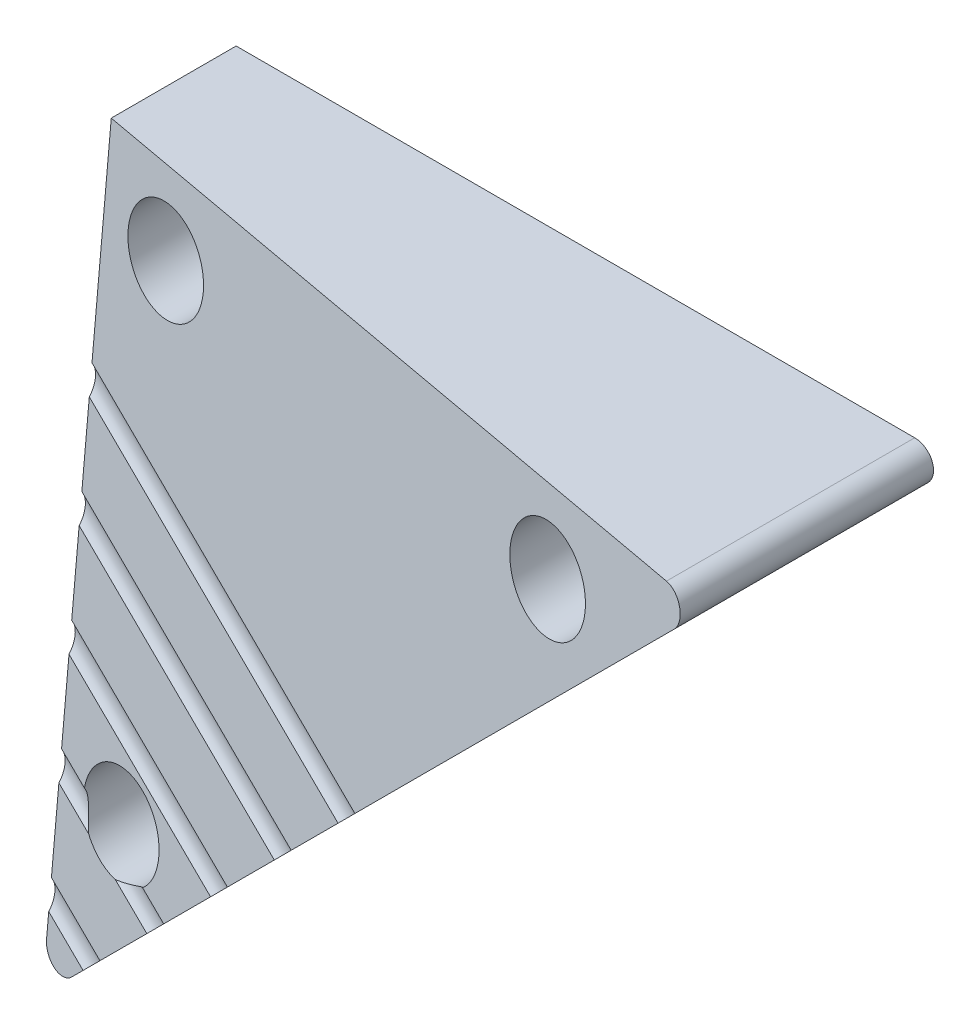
ISO-10303-21;
HEADER;
FILE_DESCRIPTION(('STEP AP214'),'2;1');
FILE_NAME('part.step','',(''),(''),'','','');
FILE_SCHEMA(('AUTOMOTIVE_DESIGN { 1 0 10303 214 1 1 1 1 }'));
ENDSEC;
DATA;
#1=APPLICATION_CONTEXT('core data for automotive mechanical design processes');
#2=APPLICATION_PROTOCOL_DEFINITION('international standard','automotive_design',2000,#1);
#3=PRODUCT_CONTEXT('',#1,'mechanical');
#4=PRODUCT('Part','Part','',(#3));
#5=PRODUCT_RELATED_PRODUCT_CATEGORY('part','',(#4));
#6=PRODUCT_DEFINITION_FORMATION('','',#4);
#7=PRODUCT_DEFINITION_CONTEXT('part definition',#1,'design');
#8=PRODUCT_DEFINITION('design','',#6,#7);
#9=PRODUCT_DEFINITION_SHAPE('','',#8);
#10=(LENGTH_UNIT() NAMED_UNIT(*) SI_UNIT(.MILLI.,.METRE.));
#11=(NAMED_UNIT(*) PLANE_ANGLE_UNIT() SI_UNIT($,.RADIAN.));
#12=(NAMED_UNIT(*) SI_UNIT($,.STERADIAN.) SOLID_ANGLE_UNIT());
#13=UNCERTAINTY_MEASURE_WITH_UNIT(LENGTH_MEASURE(1.E-05),#10,'distance_accuracy_value','');
#14=(GEOMETRIC_REPRESENTATION_CONTEXT(3) GLOBAL_UNCERTAINTY_ASSIGNED_CONTEXT((#13)) GLOBAL_UNIT_ASSIGNED_CONTEXT((#10,
#11,#12)) REPRESENTATION_CONTEXT('',''));
#15=CARTESIAN_POINT('',(0.,0.,0.));
#16=DIRECTION('',(0.,0.,1.));
#17=DIRECTION('',(1.,0.,0.));
#18=AXIS2_PLACEMENT_3D('',#15,#16,#17);
#19=CARTESIAN_POINT('',(-1183.64,57.8565634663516,44.45));
#20=DIRECTION('',(0.,0.,1.));
#21=DIRECTION('',(1.,0.,0.));
#22=AXIS2_PLACEMENT_3D('',#19,#20,#21);
#23=CYLINDRICAL_SURFACE('',#22,7.73430000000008);
#24=CARTESIAN_POINT('',(-1183.64,57.8565634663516,7.874));
#25=DIRECTION('',(0.,0.,1.));
#26=DIRECTION('',(1.,0.,0.));
#27=AXIS2_PLACEMENT_3D('',#24,#25,#26);
#28=CIRCLE('',#27,7.73430000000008);
#29=CARTESIAN_POINT('',(-1175.9057,57.8565634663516,7.874));
#30=VERTEX_POINT('',#29);
#31=EDGE_CURVE('E241',#30,#30,#28,.T.);
#32=ORIENTED_EDGE('',*,*,#31,.F.);
#33=EDGE_LOOP('',(#32));
#34=FACE_BOUND('',#33,.T.);
#35=CARTESIAN_POINT('',(-1191.11849833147,59.8292416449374,32.9498366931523));
#36=CARTESIAN_POINT('',(-1191.11850635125,59.8292354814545,33.1360177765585));
#37=CARTESIAN_POINT('',(-1191.12267397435,59.8136131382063,33.322429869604));
#38=CARTESIAN_POINT('',(-1191.13851910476,59.7519727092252,33.6900807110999));
#39=CARTESIAN_POINT('',(-1191.15021296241,59.7058884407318,33.8713072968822));
#40=CARTESIAN_POINT('',(-1191.17899350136,59.5848034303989,34.2229641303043));
#41=CARTESIAN_POINT('',(-1191.19606906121,59.5098622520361,34.3934157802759));
#42=CARTESIAN_POINT('',(-1191.23256691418,59.3331870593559,34.7193758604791));
#43=CARTESIAN_POINT('',(-1191.25198794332,59.2314674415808,34.8748922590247));
#44=CARTESIAN_POINT('',(-1191.29003077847,59.0012579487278,35.1711559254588));
#45=CARTESIAN_POINT('',(-1191.30862033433,58.8721607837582,35.3114350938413));
#46=CARTESIAN_POINT('',(-1191.34044970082,58.5928999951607,35.569857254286));
#47=CARTESIAN_POINT('',(-1191.35368838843,58.4427319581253,35.687995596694));
#48=CARTESIAN_POINT('',(-1191.37159531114,58.1194170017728,35.9052537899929));
#49=CARTESIAN_POINT('',(-1191.37587608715,57.945565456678,36.0033540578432));
#50=CARTESIAN_POINT('',(-1191.37165819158,57.5859869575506,36.1740579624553));
#51=CARTESIAN_POINT('',(-1191.36315662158,57.4002573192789,36.2466558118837));
#52=CARTESIAN_POINT('',(-1191.33010882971,57.0055378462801,36.3732751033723));
#53=CARTESIAN_POINT('',(-1191.30419808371,56.7959516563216,36.4250597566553));
#54=CARTESIAN_POINT('',(-1191.23409515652,56.3751144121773,36.5034256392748));
#55=CARTESIAN_POINT('',(-1191.18988992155,56.1638622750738,36.5299888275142));
#56=CARTESIAN_POINT('',(-1191.09741530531,55.7993951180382,36.5576081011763));
#57=CARTESIAN_POINT('',(-1191.05323434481,55.6454546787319,36.5635190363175));
#58=CARTESIAN_POINT('',(-1190.95536203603,55.3405130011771,36.56532725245));
#59=CARTESIAN_POINT('',(-1190.90166706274,55.1895129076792,36.5612207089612));
#60=CARTESIAN_POINT('',(-1190.78512290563,54.8913863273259,36.5445554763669));
#61=CARTESIAN_POINT('',(-1190.72226252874,54.7442648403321,36.531986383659));
#62=CARTESIAN_POINT('',(-1190.58784740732,54.4547542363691,36.4999171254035));
#63=CARTESIAN_POINT('',(-1190.51628752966,54.3123679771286,36.4804128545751));
#64=CARTESIAN_POINT('',(-1190.33810056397,53.9834320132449,36.4280946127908));
#65=CARTESIAN_POINT('',(-1190.22803022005,53.7991023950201,36.3930132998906));
#66=CARTESIAN_POINT('',(-1189.99369495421,53.441165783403,36.316637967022));
#67=CARTESIAN_POINT('',(-1189.86943151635,53.2675576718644,36.2753445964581));
#68=CARTESIAN_POINT('',(-1189.60697687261,52.9310956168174,36.190554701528));
#69=CARTESIAN_POINT('',(-1189.468751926,52.7682693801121,36.1470529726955));
#70=CARTESIAN_POINT('',(-1189.17893232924,52.4542264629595,36.0630916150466));
#71=CARTESIAN_POINT('',(-1189.02734609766,52.3030025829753,36.022630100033));
#72=CARTESIAN_POINT('',(-1188.77935514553,52.075451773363,35.9673173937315));
#73=CARTESIAN_POINT('',(-1188.68746688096,51.995039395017,35.9489616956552));
#74=CARTESIAN_POINT('',(-1188.4994197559,51.8382229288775,35.9173593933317));
#75=CARTESIAN_POINT('',(-1188.40326026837,51.7618194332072,35.9041135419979));
#76=CARTESIAN_POINT('',(-1188.20763431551,51.6138850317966,35.8848528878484));
#77=CARTESIAN_POINT('',(-1188.10819729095,51.5423224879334,35.878785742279));
#78=CARTESIAN_POINT('',(-1187.90596941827,51.4039756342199,35.8757879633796));
#79=CARTESIAN_POINT('',(-1187.80318109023,51.3371878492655,35.878850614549));
#80=CARTESIAN_POINT('',(-1187.59362084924,51.2079811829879,35.8958276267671));
#81=CARTESIAN_POINT('',(-1187.48681255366,51.1456411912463,35.9099012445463));
#82=CARTESIAN_POINT('',(-1187.27200083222,51.0269932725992,35.9495740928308));
#83=CARTESIAN_POINT('',(-1187.16399740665,50.9706853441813,35.9751733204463));
#84=CARTESIAN_POINT('',(-1186.9473897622,50.864050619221,36.0370915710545));
#85=CARTESIAN_POINT('',(-1186.83878543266,50.813757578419,36.0734674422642));
#86=CARTESIAN_POINT('',(-1186.62219018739,50.7193437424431,36.1549686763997));
#87=CARTESIAN_POINT('',(-1186.51419953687,50.6752254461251,36.2000975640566));
#88=CARTESIAN_POINT('',(-1186.23057944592,50.5665785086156,36.3277163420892));
#89=CARTESIAN_POINT('',(-1186.05559340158,50.5069042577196,36.4157191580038));
#90=CARTESIAN_POINT('',(-1185.7067192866,50.4012755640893,36.6015361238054));
#91=CARTESIAN_POINT('',(-1185.53283232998,50.3553333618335,36.6993589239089));
#92=CARTESIAN_POINT('',(-1185.18407863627,50.2758431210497,36.9000270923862));
#93=CARTESIAN_POINT('',(-1185.00921099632,50.2423514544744,37.0028929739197));
#94=CARTESIAN_POINT('',(-1184.65827237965,50.1875327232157,37.2096015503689));
#95=CARTESIAN_POINT('',(-1184.48220192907,50.1662006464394,37.3134438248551));
#96=CARTESIAN_POINT('',(-1184.09607412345,50.1328711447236,37.5380089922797));
#97=CARTESIAN_POINT('',(-1183.8856110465,50.1232493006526,37.6584008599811));
#98=CARTESIAN_POINT('',(-1183.46097232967,50.1214209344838,37.8929873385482));
#99=CARTESIAN_POINT('',(-1183.24679468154,50.1292241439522,38.0071784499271));
#100=CARTESIAN_POINT('',(-1182.81584806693,50.1632792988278,38.2246264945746));
#101=CARTESIAN_POINT('',(-1182.59910104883,50.189425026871,38.3279424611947));
#102=CARTESIAN_POINT('',(-1182.16241982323,50.2614986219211,38.5195203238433));
#103=CARTESIAN_POINT('',(-1181.94249020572,50.3074003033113,38.6078019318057));
#104=CARTESIAN_POINT('',(-1181.52255080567,50.4149232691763,38.7555669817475));
#105=CARTESIAN_POINT('',(-1181.32273743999,50.4745248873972,38.8170423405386));
#106=CARTESIAN_POINT('',(-1180.92313518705,50.612079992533,38.9171107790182));
#107=CARTESIAN_POINT('',(-1180.72334638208,50.6900441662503,38.9556904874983));
#108=CARTESIAN_POINT('',(-1180.42555534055,50.8210259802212,38.9910053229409));
#109=CARTESIAN_POINT('',(-1180.32590535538,50.8674070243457,38.9989920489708));
#110=CARTESIAN_POINT('',(-1180.12844577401,50.9645058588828,39.006139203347));
#111=CARTESIAN_POINT('',(-1180.03063508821,51.0152209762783,39.0053050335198));
#112=CARTESIAN_POINT('',(-1179.83788072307,51.1204434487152,38.9938087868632));
#113=CARTESIAN_POINT('',(-1179.74293178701,51.1749431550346,38.9831660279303));
#114=CARTESIAN_POINT('',(-1179.55679157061,51.2870415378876,38.9512017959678));
#115=CARTESIAN_POINT('',(-1179.46559843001,51.3446386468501,38.9298856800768));
#116=CARTESIAN_POINT('',(-1179.25255257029,51.4853955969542,38.8650766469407));
#117=CARTESIAN_POINT('',(-1179.13297120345,51.5695919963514,38.8161303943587));
#118=CARTESIAN_POINT('',(-1178.90637093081,51.7383816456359,38.6953268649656));
#119=CARTESIAN_POINT('',(-1178.79934667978,51.8229747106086,38.6234793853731));
#120=CARTESIAN_POINT('',(-1178.60007231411,51.9884000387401,38.457866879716));
#121=CARTESIAN_POINT('',(-1178.5078407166,52.0692274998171,38.3640747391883));
#122=CARTESIAN_POINT('',(-1178.33967381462,52.2228297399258,38.1572485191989));
#123=CARTESIAN_POINT('',(-1178.26374339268,52.2956021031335,38.0442086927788));
#124=CARTESIAN_POINT('',(-1178.12941839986,52.4286968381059,37.8040859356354));
#125=CARTESIAN_POINT('',(-1178.07080526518,52.4891710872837,37.6772084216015));
#126=CARTESIAN_POINT('',(-1177.96939150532,52.5964251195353,37.4119075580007));
#127=CARTESIAN_POINT('',(-1177.92659393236,52.6432022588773,37.2734819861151));
#128=CARTESIAN_POINT('',(-1177.85368079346,52.7242047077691,36.9786466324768));
#129=CARTESIAN_POINT('',(-1177.82467177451,52.7573128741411,36.8216569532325));
#130=CARTESIAN_POINT('',(-1177.78325442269,52.8049382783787,36.5027539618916));
#131=CARTESIAN_POINT('',(-1177.77085159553,52.8194493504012,36.3408390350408));
#132=CARTESIAN_POINT('',(-1177.76177422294,52.8300406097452,36.0035784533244));
#133=CARTESIAN_POINT('',(-1177.76637170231,52.8246303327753,35.8281504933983));
#134=CARTESIAN_POINT('',(-1177.79385193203,52.7927337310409,35.4806850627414));
#135=CARTESIAN_POINT('',(-1177.81673876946,52.766242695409,35.3086483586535));
#136=CARTESIAN_POINT('',(-1177.88236335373,52.692109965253,34.9638599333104));
#137=CARTESIAN_POINT('',(-1177.92602885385,52.6434849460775,34.7914954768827));
#138=CARTESIAN_POINT('',(-1178.03353486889,52.5280430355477,34.4596554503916));
#139=CARTESIAN_POINT('',(-1178.09737733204,52.461224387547,34.3001811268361));
#140=CARTESIAN_POINT('',(-1178.24753686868,52.3110847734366,33.9929268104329));
#141=CARTESIAN_POINT('',(-1178.33452484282,52.2272928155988,33.8457048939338));
#142=CARTESIAN_POINT('',(-1178.52912394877,52.0500475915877,33.572254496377));
#143=CARTESIAN_POINT('',(-1178.63673669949,51.9565935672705,33.4460276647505));
#144=CARTESIAN_POINT('',(-1178.87549183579,51.7620239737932,33.2121018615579));
#145=CARTESIAN_POINT('',(-1179.00737235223,51.6607522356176,33.1052881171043));
#146=CARTESIAN_POINT('',(-1179.28904121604,51.459807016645,32.9168518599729));
#147=CARTESIAN_POINT('',(-1179.4388334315,51.3601338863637,32.8352348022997));
#148=CARTESIAN_POINT('',(-1179.76517967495,51.1599562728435,32.6908779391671));
#149=CARTESIAN_POINT('',(-1179.94290608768,51.0599781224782,32.6300742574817));
#150=CARTESIAN_POINT('',(-1180.31122390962,50.8721932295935,32.5339036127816));
#151=CARTESIAN_POINT('',(-1180.50182366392,50.7843944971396,32.4985533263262));
#152=CARTESIAN_POINT('',(-1180.8369945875,50.6464572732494,32.4566888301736));
#153=CARTESIAN_POINT('',(-1180.97946451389,50.5926661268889,32.4448651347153));
#154=CARTESIAN_POINT('',(-1181.26780808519,50.4934569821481,32.4311841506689));
#155=CARTESIAN_POINT('',(-1181.41368289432,50.4480418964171,32.429330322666));
#156=CARTESIAN_POINT('',(-1181.70788435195,50.3659232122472,32.4342159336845));
#157=CARTESIAN_POINT('',(-1181.85621378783,50.3292303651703,32.440965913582));
#158=CARTESIAN_POINT('',(-1182.15431015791,50.2647658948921,32.4617152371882));
#159=CARTESIAN_POINT('',(-1182.30407746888,50.2369966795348,32.4757165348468));
#160=CARTESIAN_POINT('',(-1182.65880165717,50.1819624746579,32.5158112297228));
#161=CARTESIAN_POINT('',(-1182.86407162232,50.1585342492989,32.5444486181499));
#162=CARTESIAN_POINT('',(-1183.2746308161,50.1281535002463,32.6094825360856));
#163=CARTESIAN_POINT('',(-1183.47992000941,50.1212086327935,32.6458826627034));
#164=CARTESIAN_POINT('',(-1183.89006868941,50.1235800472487,32.7231445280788));
#165=CARTESIAN_POINT('',(-1184.09492579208,50.1329373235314,32.7640172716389));
#166=CARTESIAN_POINT('',(-1184.50309151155,50.167843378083,32.8462571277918));
#167=CARTESIAN_POINT('',(-1184.70640068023,50.1933860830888,32.8876240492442));
#168=CARTESIAN_POINT('',(-1185.04359435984,50.2494622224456,32.9527378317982));
#169=CARTESIAN_POINT('',(-1185.17799425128,50.2754819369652,32.9777562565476));
#170=CARTESIAN_POINT('',(-1185.44591237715,50.3348017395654,33.0237787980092));
#171=CARTESIAN_POINT('',(-1185.5794305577,50.3681022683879,33.0447826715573));
#172=CARTESIAN_POINT('',(-1185.84456792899,50.4418416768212,33.0801946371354));
#173=CARTESIAN_POINT('',(-1185.97619361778,50.4822385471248,33.0946398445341));
#174=CARTESIAN_POINT('',(-1186.23772770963,50.5702606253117,33.1141758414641));
#175=CARTESIAN_POINT('',(-1186.3676369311,50.6178822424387,33.1192712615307));
#176=CARTESIAN_POINT('',(-1186.59869448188,50.7096964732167,33.1174235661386));
#177=CARTESIAN_POINT('',(-1186.70035278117,50.7526393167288,33.1127038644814));
#178=CARTESIAN_POINT('',(-1186.9010765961,50.8425162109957,33.094444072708));
#179=CARTESIAN_POINT('',(-1187.00014271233,50.8894493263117,33.0809060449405));
#180=CARTESIAN_POINT('',(-1187.19490282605,50.9867801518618,33.0447723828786));
#181=CARTESIAN_POINT('',(-1187.2905956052,51.037179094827,33.0221735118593));
#182=CARTESIAN_POINT('',(-1187.47798567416,51.1408550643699,32.9685824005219));
#183=CARTESIAN_POINT('',(-1187.56968189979,51.1941328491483,32.9375879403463));
#184=CARTESIAN_POINT('',(-1187.7916977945,51.3291717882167,32.8519373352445));
#185=CARTESIAN_POINT('',(-1187.91950797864,51.4123655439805,32.7930551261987));
#186=CARTESIAN_POINT('',(-1188.16633995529,51.5832683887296,32.6644469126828));
#187=CARTESIAN_POINT('',(-1188.28535368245,51.6709814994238,32.5947111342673));
#188=CARTESIAN_POINT('',(-1188.51650295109,51.8515001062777,32.4478462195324));
#189=CARTESIAN_POINT('',(-1188.62857530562,51.944340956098,32.370662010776));
#190=CARTESIAN_POINT('',(-1188.84571532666,52.1346111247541,32.2123795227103));
#191=CARTESIAN_POINT('',(-1188.95078489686,52.2320391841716,32.1312823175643));
#192=CARTESIAN_POINT('',(-1189.22505241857,52.5007372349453,31.9107793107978));
#193=CARTESIAN_POINT('',(-1189.38849023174,52.6765838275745,31.769741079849));
#194=CARTESIAN_POINT('',(-1189.69935813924,53.0439306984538,31.4899894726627));
#195=CARTESIAN_POINT('',(-1189.84677515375,53.2354435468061,31.3512780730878));
#196=CARTESIAN_POINT('',(-1190.12450595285,53.6340996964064,31.0830308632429));
#197=CARTESIAN_POINT('',(-1190.25492737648,53.8411300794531,30.9534399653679));
#198=CARTESIAN_POINT('',(-1190.49841921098,54.2728838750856,30.7086236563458));
#199=CARTESIAN_POINT('',(-1190.61151464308,54.4975810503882,30.5933775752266));
#200=CARTESIAN_POINT('',(-1190.8027519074,54.9305202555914,30.4002012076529));
#201=CARTESIAN_POINT('',(-1190.88359130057,55.1362129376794,30.319268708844));
#202=CARTESIAN_POINT('',(-1191.02919372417,55.5610204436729,30.179170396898));
#203=CARTESIAN_POINT('',(-1191.09393899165,55.7801497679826,30.1200285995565));
#204=CARTESIAN_POINT('',(-1191.17734207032,56.1182741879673,30.0535937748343));
#205=CARTESIAN_POINT('',(-1191.20298847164,56.2334007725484,30.0351122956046));
#206=CARTESIAN_POINT('',(-1191.24915495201,56.4658167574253,30.0071317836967));
#207=CARTESIAN_POINT('',(-1191.26967442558,56.5831064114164,29.9976338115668));
#208=CARTESIAN_POINT('',(-1191.30525563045,56.8185922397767,29.9889560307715));
#209=CARTESIAN_POINT('',(-1191.32033247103,56.9367849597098,29.989747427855));
#210=CARTESIAN_POINT('',(-1191.34495415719,57.1730511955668,30.0028533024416));
#211=CARTESIAN_POINT('',(-1191.35450245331,57.2911247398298,30.0151605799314));
#212=CARTESIAN_POINT('',(-1191.37029602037,57.5634170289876,30.0584592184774));
#213=CARTESIAN_POINT('',(-1191.37449246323,57.7170522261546,30.094185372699));
#214=CARTESIAN_POINT('',(-1191.37409374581,58.0167302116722,30.1894422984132));
#215=CARTESIAN_POINT('',(-1191.369503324,58.1627770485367,30.2489602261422));
#216=CARTESIAN_POINT('',(-1191.35332963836,58.4428163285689,30.3919651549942));
#217=CARTESIAN_POINT('',(-1191.34172534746,58.5767711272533,30.4755238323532));
#218=CARTESIAN_POINT('',(-1191.314133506,58.8276720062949,30.6645852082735));
#219=CARTESIAN_POINT('',(-1191.29814542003,58.9446160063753,30.7700905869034));
#220=CARTESIAN_POINT('',(-1191.26547747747,59.1535636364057,30.9945246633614));
#221=CARTESIAN_POINT('',(-1191.2488595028,59.2464416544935,31.1126531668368));
#222=CARTESIAN_POINT('',(-1191.21670677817,59.4122179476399,31.3623482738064));
#223=CARTESIAN_POINT('',(-1191.20117258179,59.4851060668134,31.493921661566));
#224=CARTESIAN_POINT('',(-1191.17238363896,59.6136022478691,31.7744123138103));
#225=CARTESIAN_POINT('',(-1191.15930316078,59.6680273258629,31.9238868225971));
#226=CARTESIAN_POINT('',(-1191.13819235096,59.7535244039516,32.2295245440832));
#227=CARTESIAN_POINT('',(-1191.13015555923,59.7846262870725,32.3856789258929));
#228=CARTESIAN_POINT('',(-1191.12288098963,59.8125648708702,32.6106300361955));
#229=CARTESIAN_POINT('',(-1191.12123968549,59.8188252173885,32.67830412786));
#230=CARTESIAN_POINT('',(-1191.1190469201,59.8271646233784,32.8139207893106));
#231=CARTESIAN_POINT('',(-1191.1184954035,59.8292438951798,32.8818633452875));
#232=CARTESIAN_POINT('',(-1191.11849833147,59.8292416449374,32.9498366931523));
#233=B_SPLINE_CURVE_WITH_KNOTS('',3,(#35,#36,#37,#38,#39,#40,#41,#42,#43,#44,#45,#46,#47,#48,
#49,#50,#51,#52,#53,#54,#55,#56,#57,#58,#59,#60,#61,#62,#63,#64,#65,#66,#67,#68,#69,#70,#71,#72,
#73,#74,#75,#76,#77,#78,#79,#80,#81,#82,#83,#84,#85,#86,#87,#88,#89,#90,#91,#92,#93,#94,#95,#96,
#97,#98,#99,#100,#101,#102,#103,#104,#105,#106,#107,#108,#109,#110,#111,#112,#113,#114,#115,
#116,#117,#118,#119,#120,#121,#122,#123,#124,#125,#126,#127,#128,#129,#130,#131,#132,#133,#134,
#135,#136,#137,#138,#139,#140,#141,#142,#143,#144,#145,#146,#147,#148,#149,#150,#151,#152,#153,
#154,#155,#156,#157,#158,#159,#160,#161,#162,#163,#164,#165,#166,#167,#168,#169,#170,#171,#172,
#173,#174,#175,#176,#177,#178,#179,#180,#181,#182,#183,#184,#185,#186,#187,#188,#189,#190,#191,
#192,#193,#194,#195,#196,#197,#198,#199,#200,#201,#202,#203,#204,#205,#206,#207,#208,#209,#210,
#211,#212,#213,#214,#215,#216,#217,#218,#219,#220,#221,#222,#223,#224,#225,#226,#227,#228,#229,
#230,#231,#232),.UNSPECIFIED.,.T.,.F.,(4,2,2,2,2,2,2,2,2,2,2,2,2,2,2,2,2,2,2,2,2,2,2,2,2,2,2,2,
2,2,2,2,2,2,2,2,2,2,2,2,2,2,2,2,2,2,2,2,2,2,2,2,2,2,2,2,2,2,2,2,2,2,2,2,2,2,2,2,2,2,2,2,2,2,2,2,
2,2,2,2,2,2,2,2,2,2,2,2,2,2,2,2,2,2,2,2,2,2,4),(0.,0.558282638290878,1.11778222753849,
1.67613309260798,2.23418438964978,2.80622837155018,3.3783923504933,3.97483213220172,
4.57140717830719,5.22123717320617,5.87153164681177,6.3517073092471,6.83206632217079,
7.3130169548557,7.79425276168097,8.44593664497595,9.09755244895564,9.75078250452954,
10.4036038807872,10.7738454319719,11.1441415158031,11.511720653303,11.8790294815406,
12.2517513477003,12.6244731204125,12.9991971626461,13.3740724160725,13.9872601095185,
14.6009927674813,15.217471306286,15.8336955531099,16.5609916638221,17.2886940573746,
18.0122169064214,18.7347836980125,19.3854223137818,20.0364405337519,20.3666808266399,
20.696718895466,21.0261083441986,21.3553326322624,21.8158116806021,22.276093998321,
22.736948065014,23.1979399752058,23.6528372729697,24.1078223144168,24.5948777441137,
25.0820946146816,25.6064792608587,26.1309811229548,26.6814819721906,27.2320359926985,
27.8007210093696,28.3694506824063,28.9597697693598,29.5502165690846,30.1861027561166,
30.8224051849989,31.2800595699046,31.7378727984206,32.1962474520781,32.6547456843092,
33.2795591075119,33.9046626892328,34.5313404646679,35.1577832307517,35.5750687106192,
35.9923794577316,36.4072982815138,36.8220115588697,37.152971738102,37.4838545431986,
37.8148556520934,38.1459443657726,38.6354309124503,39.1253608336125,39.6192405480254,
40.112985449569,40.9473233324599,41.7823373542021,42.6117752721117,43.4400038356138,
44.1446189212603,44.8500082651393,45.2077896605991,45.5656132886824,45.9224357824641,
46.279035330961,46.7502805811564,47.2212717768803,47.6936820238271,48.1661499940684,
48.6177190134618,49.0695170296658,49.5463796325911,50.022630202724,50.226465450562,
50.4302903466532),.UNSPECIFIED.);
#234=CARTESIAN_POINT('',(-1178.55611389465,52.0278844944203,33.5468018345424));
#235=VERTEX_POINT('',#234);
#236=CARTESIAN_POINT('',(-1183.98043698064,50.1297595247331,32.7415354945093));
#237=VERTEX_POINT('',#236);
#238=EDGE_CURVE('E72',#235,#237,#233,.T.);
#239=ORIENTED_EDGE('',*,*,#238,.F.);
#240=CARTESIAN_POINT('',(-1183.64,57.8565634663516,32.0667311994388));
#241=DIRECTION('',(0.178103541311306,-0.0933957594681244,-0.97956947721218));
#242=DIRECTION('',(0.867526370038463,-0.454922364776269,0.201106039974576));
#243=AXIS2_PLACEMENT_3D('',#240,#241,#242);
#244=ELLIPSE('',#243,7.89561147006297,7.73430000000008);
#245=CARTESIAN_POINT('',(-1191.32549969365,58.7240258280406,30.5866605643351));
#246=VERTEX_POINT('',#245);
#247=EDGE_CURVE('E294',#235,#246,#244,.F.);
#248=ORIENTED_EDGE('',*,*,#247,.T.);
#249=CARTESIAN_POINT('',(-1189.80234586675,53.1827117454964,31.3919269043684));
#250=VERTEX_POINT('',#249);
#251=EDGE_CURVE('E196',#250,#246,#233,.T.);
#252=ORIENTED_EDGE('',*,*,#251,.F.);
#253=EDGE_CURVE('E379',#250,#237,#244,.F.);
#254=ORIENTED_EDGE('',*,*,#253,.T.);
#255=EDGE_LOOP('',(#239,#248,#252,#254));
#256=FACE_BOUND('',#255,.T.);
#257=ADVANCED_FACE('F56',(#34,#256),#23,.F.);
#258=CARTESIAN_POINT('',(-36.3480405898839,19.0605578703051,244.364223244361));
#259=DIRECTION('',(0.178103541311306,-0.0933957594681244,-0.97956947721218));
#260=DIRECTION('',(-0.983869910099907,0.,-0.178885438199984));
#261=AXIS2_PLACEMENT_3D('',#258,#259,#260);
#262=PLANE('',#261);
#263=DIRECTION('',(0.867526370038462,-0.454922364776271,0.201106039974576));
#264=VECTOR('',#263,1.);
#265=CARTESIAN_POINT('',(-1221.40754057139,110.349343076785,20.1950508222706));
#266=LINE('',#265,#264);
#267=CARTESIAN_POINT('',(-1150.41467450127,73.1213767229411,36.6522959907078));
#268=VERTEX_POINT('',#267);
#269=CARTESIAN_POINT('',(-1196.34,97.2041693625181,26.0060947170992));
#270=VERTEX_POINT('',#269);
#271=EDGE_CURVE('E12',#268,#270,#266,.F.);
#272=ORIENTED_EDGE('',*,*,#271,.F.);
#273=DIRECTION('',(-0.705788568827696,-0.705788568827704,-0.0610327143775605));
#274=VECTOR('',#273,1.);
#275=CARTESIAN_POINT('',(-1195.83303312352,27.7030181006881,32.724766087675));
#276=LINE('',#275,#274);
#277=CARTESIAN_POINT('',(-1141.76681859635,81.7692326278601,37.4001150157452));
#278=VERTEX_POINT('',#277);
#279=EDGE_CURVE('E216',#278,#268,#276,.T.);
#280=ORIENTED_EDGE('',*,*,#279,.F.);
#281=DIRECTION('',(0.867526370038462,-0.454922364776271,0.201106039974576));
#282=VECTOR('',#281,1.);
#283=CARTESIAN_POINT('',(-1215.98560828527,120.688841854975,20.1950508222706));
#284=LINE('',#283,#282);
#285=CARTESIAN_POINT('',(-1196.34,110.386876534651,24.7492068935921));
#286=VERTEX_POINT('',#285);
#287=EDGE_CURVE('E301',#286,#278,#284,.T.);
#288=ORIENTED_EDGE('',*,*,#287,.F.);
#289=DIRECTION('',(0.,0.995485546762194,-0.0949132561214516));
#290=VECTOR('',#289,1.);
#291=CARTESIAN_POINT('',(-1196.34,147.013700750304,21.2570706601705));
#292=LINE('',#291,#290);
#293=EDGE_CURVE('E413',#270,#286,#292,.T.);
#294=ORIENTED_EDGE('',*,*,#293,.F.);
#295=EDGE_LOOP('',(#272,#280,#288,#294));
#296=FACE_BOUND('',#295,.T.);
#297=ADVANCED_FACE('F470',(#296),#262,.F.);
#298=DIRECTION('',(0.867526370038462,-0.454922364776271,0.201106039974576));
#299=VECTOR('',#298,1.);
#300=CARTESIAN_POINT('',(-1223.35812520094,106.629623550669,20.1950508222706));
#301=LINE('',#300,#299);
#302=CARTESIAN_POINT('',(-1196.34,92.4615822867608,26.4582704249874));
#303=VERTEX_POINT('',#302);
#304=CARTESIAN_POINT('',(-1153.52581162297,70.0102396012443,36.3832619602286));
#305=VERTEX_POINT('',#304);
#306=EDGE_CURVE('E65',#303,#305,#301,.T.);
#307=ORIENTED_EDGE('',*,*,#306,.F.);
#308=CARTESIAN_POINT('',(-1196.34,79.2788751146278,27.7151582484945));
#309=VERTEX_POINT('',#308);
#310=EDGE_CURVE('E419',#309,#303,#292,.T.);
#311=ORIENTED_EDGE('',*,*,#310,.F.);
#312=DIRECTION('',(0.867526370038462,-0.454922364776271,0.201106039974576));
#313=VECTOR('',#312,1.);
#314=CARTESIAN_POINT('',(-1228.78005748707,96.2901247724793,20.1950508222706));
#315=LINE('',#314,#313);
#316=CARTESIAN_POINT('',(-1162.17366752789,61.3623836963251,35.6354429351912));
#317=VERTEX_POINT('',#316);
#318=EDGE_CURVE('E315',#317,#309,#315,.F.);
#319=ORIENTED_EDGE('',*,*,#318,.F.);
#320=EDGE_CURVE('E208',#305,#317,#276,.T.);
#321=ORIENTED_EDGE('',*,*,#320,.F.);
#322=EDGE_LOOP('',(#307,#311,#319,#321));
#323=FACE_BOUND('',#322,.T.);
#324=ADVANCED_FACE('F336',(#323),#262,.F.);
#325=DIRECTION('',(0.867526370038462,-0.454922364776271,0.201106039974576));
#326=VECTOR('',#325,1.);
#327=CARTESIAN_POINT('',(-1230.73064211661,92.5704052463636,20.1950508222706));
#328=LINE('',#327,#326);
#329=CARTESIAN_POINT('',(-1196.34,74.5362880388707,28.1673339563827));
#330=VERTEX_POINT('',#329);
#331=CARTESIAN_POINT('',(-1165.28480464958,58.2512465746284,35.3664089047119));
#332=VERTEX_POINT('',#331);
#333=EDGE_CURVE('E312',#330,#332,#328,.T.);
#334=ORIENTED_EDGE('',*,*,#333,.F.);
#335=CARTESIAN_POINT('',(-1196.34,61.3535808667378,29.4242217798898));
#336=VERTEX_POINT('',#335);
#337=EDGE_CURVE('E411',#336,#330,#292,.T.);
#338=ORIENTED_EDGE('',*,*,#337,.F.);
#339=DIRECTION('',(0.867526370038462,-0.454922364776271,0.201106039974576));
#340=VECTOR('',#339,1.);
#341=CARTESIAN_POINT('',(-1236.15257440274,82.2309064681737,20.1950508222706));
#342=LINE('',#341,#340);
#343=EDGE_CURVE('E297',#246,#336,#342,.F.);
#344=ORIENTED_EDGE('',*,*,#343,.F.);
#345=ORIENTED_EDGE('',*,*,#247,.F.);
#346=CARTESIAN_POINT('',(-1173.9326605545,49.6033906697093,34.6185898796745));
#347=VERTEX_POINT('',#346);
#348=EDGE_CURVE('E300',#347,#235,#342,.F.);
#349=ORIENTED_EDGE('',*,*,#348,.F.);
#350=EDGE_CURVE('E194',#332,#347,#276,.T.);
#351=ORIENTED_EDGE('',*,*,#350,.F.);
#352=EDGE_LOOP('',(#334,#338,#344,#345,#349,#351));
#353=FACE_BOUND('',#352,.T.);
#354=ADVANCED_FACE('F384',(#353),#262,.F.);
#355=DIRECTION('',(0.867526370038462,-0.454922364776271,0.201106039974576));
#356=VECTOR('',#355,1.);
#357=CARTESIAN_POINT('',(-1243.52509131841,68.1716881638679,20.1950508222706));
#358=LINE('',#357,#356);
#359=CARTESIAN_POINT('',(-1185.69165358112,37.8443976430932,33.6017368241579));
#360=VERTEX_POINT('',#359);
#361=CARTESIAN_POINT('',(-1196.34,43.4282866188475,31.1332853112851));
#362=VERTEX_POINT('',#361);
#363=EDGE_CURVE('E201',#360,#362,#358,.F.);
#364=ORIENTED_EDGE('',*,*,#363,.F.);
#365=CARTESIAN_POINT('',(-1177.0437976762,46.4922535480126,34.3495558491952));
#366=VERTEX_POINT('',#365);
#367=EDGE_CURVE('E191',#366,#360,#276,.T.);
#368=ORIENTED_EDGE('',*,*,#367,.F.);
#369=DIRECTION('',(0.867526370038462,-0.454922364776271,0.201106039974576));
#370=VECTOR('',#369,1.);
#371=CARTESIAN_POINT('',(-1238.10315903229,78.511186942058,20.1950508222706));
#372=LINE('',#371,#370);
#373=EDGE_CURVE('E172',#237,#366,#372,.T.);
#374=ORIENTED_EDGE('',*,*,#373,.F.);
#375=ORIENTED_EDGE('',*,*,#253,.F.);
#376=CARTESIAN_POINT('',(-1196.34,56.6109937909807,29.876397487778));
#377=VERTEX_POINT('',#376);
#378=EDGE_CURVE('E182',#377,#250,#372,.T.);
#379=ORIENTED_EDGE('',*,*,#378,.F.);
#380=EDGE_CURVE('E403',#362,#377,#292,.T.);
#381=ORIENTED_EDGE('',*,*,#380,.F.);
#382=EDGE_LOOP('',(#364,#368,#374,#375,#379,#381));
#383=FACE_BOUND('',#382,.T.);
#384=ADVANCED_FACE('F199',(#383),#262,.F.);
#385=DIRECTION('',(0.867526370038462,-0.454922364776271,0.201106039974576));
#386=VECTOR('',#385,1.);
#387=CARTESIAN_POINT('',(-1245.47567594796,64.4519686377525,20.1950508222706));
#388=LINE('',#387,#386);
#389=CARTESIAN_POINT('',(-1196.34,38.6856995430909,31.5854610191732));
#390=VERTEX_POINT('',#389);
#391=CARTESIAN_POINT('',(-1188.80279070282,34.7332605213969,33.3327027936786));
#392=VERTEX_POINT('',#391);
#393=EDGE_CURVE('E307',#390,#392,#388,.T.);
#394=ORIENTED_EDGE('',*,*,#393,.F.);
#395=CARTESIAN_POINT('',(-1196.34,34.8611792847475,31.9501048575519));
#396=VERTEX_POINT('',#395);
#397=EDGE_CURVE('E400',#396,#390,#292,.T.);
#398=ORIENTED_EDGE('',*,*,#397,.F.);
#399=CARTESIAN_POINT('',(-1193.165,34.8611792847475,32.5273775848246));
#400=DIRECTION('',(0.178103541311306,-0.0933957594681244,-0.97956947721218));
#401=DIRECTION('',(-0.867526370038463,0.454922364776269,-0.201106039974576));
#402=AXIS2_PLACEMENT_3D('',#399,#400,#401);
#403=ELLIPSE('',#402,3.24121981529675,3.175);
#404=CARTESIAN_POINT('',(-1190.91993596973,32.6161152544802,33.1496237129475));
#405=VERTEX_POINT('',#404);
#406=EDGE_CURVE('E396',#396,#405,#403,.F.);
#407=ORIENTED_EDGE('',*,*,#406,.T.);
#408=EDGE_CURVE('E203',#392,#405,#276,.T.);
#409=ORIENTED_EDGE('',*,*,#408,.F.);
#410=EDGE_LOOP('',(#394,#398,#407,#409));
#411=FACE_BOUND('',#410,.T.);
#412=ADVANCED_FACE('F530',(#411),#262,.F.);
#413=CARTESIAN_POINT('',(-1104.97156346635,136.525,38.8695450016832));
#414=DIRECTION('',(0.178103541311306,-0.0933957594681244,-0.97956947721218));
#415=DIRECTION('',(0.867526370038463,-0.454922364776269,0.201106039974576));
#416=AXIS2_PLACEMENT_3D('',#413,#414,#415);
#417=ELLIPSE('',#416,7.89561147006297,7.73430000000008);
#418=CARTESIAN_POINT('',(-1098.12191230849,132.933109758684,40.4574001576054));
#419=VERTEX_POINT('',#418);
#420=EDGE_CURVE('E390',#419,#419,#417,.F.);
#421=ORIENTED_EDGE('',*,*,#420,.F.);
#422=EDGE_LOOP('',(#421));
#423=FACE_BOUND('',#422,.T.);
#424=CARTESIAN_POINT('',(-1183.64,136.525,24.5661929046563));
#425=DIRECTION('',(0.178103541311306,-0.0933957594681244,-0.97956947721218));
#426=DIRECTION('',(0.867526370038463,-0.454922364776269,0.201106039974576));
#427=AXIS2_PLACEMENT_3D('',#424,#425,#426);
#428=ELLIPSE('',#427,7.89561147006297,7.73430000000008);
#429=CARTESIAN_POINT('',(-1176.79034884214,132.933109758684,26.1540480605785));
#430=VERTEX_POINT('',#429);
#431=EDGE_CURVE('E291',#430,#430,#428,.F.);
#432=ORIENTED_EDGE('',*,*,#431,.F.);
#433=EDGE_LOOP('',(#432));
#434=FACE_BOUND('',#433,.T.);
#435=DIRECTION('',(0.867526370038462,-0.454922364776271,0.201106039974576));
#436=VECTOR('',#435,1.);
#437=CARTESIAN_POINT('',(-1214.03502365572,124.408561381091,20.1950508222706));
#438=LINE('',#437,#436);
#439=CARTESIAN_POINT('',(-1138.65568147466,84.8803697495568,37.6691490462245));
#440=VERTEX_POINT('',#439);
#441=CARTESIAN_POINT('',(-1196.34,115.129463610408,24.2970311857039));
#442=VERTEX_POINT('',#441);
#443=EDGE_CURVE('E304',#440,#442,#438,.F.);
#444=ORIENTED_EDGE('',*,*,#443,.F.);
#445=CARTESIAN_POINT('',(-1079.73111525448,143.804935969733,42.7646215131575));
#446=VERTEX_POINT('',#445);
#447=EDGE_CURVE('E210',#446,#440,#276,.T.);
#448=ORIENTED_EDGE('',*,*,#447,.F.);
#449=CARTESIAN_POINT('',(-1081.97617928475,146.05,42.1423753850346));
#450=DIRECTION('',(0.178103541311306,-0.0933957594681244,-0.97956947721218));
#451=DIRECTION('',(-0.867526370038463,0.454922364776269,-0.201106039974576));
#452=AXIS2_PLACEMENT_3D('',#449,#450,#451);
#453=ELLIPSE('',#452,3.24121981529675,3.175);
#454=CARTESIAN_POINT('',(-1081.97617928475,149.225,41.8396591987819));
#455=VERTEX_POINT('',#454);
#456=EDGE_CURVE('E215',#446,#455,#453,.F.);
#457=ORIENTED_EDGE('',*,*,#456,.T.);
#458=DIRECTION('',(0.983869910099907,0.,0.178885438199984));
#459=VECTOR('',#458,1.);
#460=CARTESIAN_POINT('',(-1074.09691534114,149.225,43.2722526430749));
#461=LINE('',#460,#459);
#462=CARTESIAN_POINT('',(-1196.34,149.225,21.0462372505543));
#463=VERTEX_POINT('',#462);
#464=EDGE_CURVE('E209',#463,#455,#461,.T.);
#465=ORIENTED_EDGE('',*,*,#464,.F.);
#466=EDGE_CURVE('E399',#442,#463,#292,.T.);
#467=ORIENTED_EDGE('',*,*,#466,.F.);
#468=EDGE_LOOP('',(#444,#448,#457,#465,#467));
#469=FACE_BOUND('',#468,.T.);
#470=ADVANCED_FACE('F474',(#423,#434,#469),#262,.F.);
#471=CARTESIAN_POINT('',(-1196.34,27.1960512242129,44.45));
#472=DIRECTION('',(-0.707106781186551,0.707106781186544,0.));
#473=DIRECTION('',(-0.707106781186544,-0.707106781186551,0.));
#474=AXIS2_PLACEMENT_3D('',#471,#472,#473);
#475=PLANE('',#474);
#476=CARTESIAN_POINT('',(-1151.97024306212,71.5658081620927,38.9486938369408));
#477=DIRECTION('',(-0.707106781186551,0.707106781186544,0.));
#478=DIRECTION('',(0.582196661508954,0.58219666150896,0.567533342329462));
#479=AXIS2_PLACEMENT_3D('',#476,#477,#478);
#480=ELLIPSE('',#479,3.39531351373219,3.17499999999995);
#481=EDGE_CURVE('E295',#305,#268,#480,.F.);
#482=ORIENTED_EDGE('',*,*,#481,.F.);
#483=ORIENTED_EDGE('',*,*,#320,.T.);
#484=CARTESIAN_POINT('',(-1163.72923608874,59.8068151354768,37.9318407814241));
#485=DIRECTION('',(-0.707106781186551,0.707106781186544,0.));
#486=DIRECTION('',(0.582196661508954,0.58219666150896,0.567533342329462));
#487=AXIS2_PLACEMENT_3D('',#484,#485,#486);
#488=ELLIPSE('',#487,3.39531351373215,3.17499999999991);
#489=EDGE_CURVE('E434',#332,#317,#488,.F.);
#490=ORIENTED_EDGE('',*,*,#489,.F.);
#491=ORIENTED_EDGE('',*,*,#350,.T.);
#492=CARTESIAN_POINT('',(-1175.48822911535,48.047822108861,36.9149877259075));
#493=DIRECTION('',(-0.707106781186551,0.707106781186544,0.));
#494=DIRECTION('',(0.582196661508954,0.58219666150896,0.567533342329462));
#495=AXIS2_PLACEMENT_3D('',#492,#493,#494);
#496=ELLIPSE('',#495,3.39531351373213,3.1749999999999);
#497=EDGE_CURVE('E175',#366,#347,#496,.F.);
#498=ORIENTED_EDGE('',*,*,#497,.F.);
#499=ORIENTED_EDGE('',*,*,#367,.T.);
#500=CARTESIAN_POINT('',(-1187.24722214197,36.2888290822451,35.8981346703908));
#501=DIRECTION('',(-0.707106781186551,0.707106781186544,0.));
#502=DIRECTION('',(0.582196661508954,0.58219666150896,0.567533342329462));
#503=AXIS2_PLACEMENT_3D('',#500,#501,#502);
#504=ELLIPSE('',#503,3.39531351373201,3.17499999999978);
#505=EDGE_CURVE('E440',#392,#360,#504,.F.);
#506=ORIENTED_EDGE('',*,*,#505,.F.);
#507=ORIENTED_EDGE('',*,*,#408,.T.);
#508=DIRECTION('',(0.,0.,-1.));
#509=VECTOR('',#508,1.);
#510=CARTESIAN_POINT('',(-1190.91993596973,32.6161152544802,44.45));
#511=LINE('',#510,#509);
#512=CARTESIAN_POINT('',(-1190.91993596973,32.6161152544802,0.));
#513=VERTEX_POINT('',#512);
#514=EDGE_CURVE('E281',#405,#513,#511,.T.);
#515=ORIENTED_EDGE('',*,*,#514,.T.);
#516=DIRECTION('',(0.707106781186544,0.707106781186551,0.));
#517=VECTOR('',#516,1.);
#518=CARTESIAN_POINT('',(-1196.34,27.1960512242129,0.));
#519=LINE('',#518,#517);
#520=CARTESIAN_POINT('',(-1079.73111525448,143.804935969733,0.));
#521=VERTEX_POINT('',#520);
#522=EDGE_CURVE('E257',#513,#521,#519,.T.);
#523=ORIENTED_EDGE('',*,*,#522,.T.);
#524=DIRECTION('',(0.,0.,-1.));
#525=VECTOR('',#524,1.);
#526=CARTESIAN_POINT('',(-1079.73111525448,143.804935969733,44.45));
#527=LINE('',#526,#525);
#528=EDGE_CURVE('E284',#521,#446,#527,.F.);
#529=ORIENTED_EDGE('',*,*,#528,.T.);
#530=ORIENTED_EDGE('',*,*,#447,.T.);
#531=CARTESIAN_POINT('',(-1140.21125003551,83.3248011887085,39.9655468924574));
#532=DIRECTION('',(-0.707106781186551,0.707106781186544,0.));
#533=DIRECTION('',(0.582196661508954,0.58219666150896,0.567533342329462));
#534=AXIS2_PLACEMENT_3D('',#531,#532,#533);
#535=ELLIPSE('',#534,3.3953135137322,3.17499999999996);
#536=EDGE_CURVE('E448',#278,#440,#535,.F.);
#537=ORIENTED_EDGE('',*,*,#536,.F.);
#538=ORIENTED_EDGE('',*,*,#279,.T.);
#539=EDGE_LOOP('',(#482,#483,#490,#491,#498,#499,#506,#507,#515,#523,#529,#530,#537,#538));
#540=FACE_BOUND('',#539,.T.);
#541=ADVANCED_FACE('F189',(#540),#475,.F.);
#542=CARTESIAN_POINT('',(-1074.31105122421,149.225,44.45));
#543=DIRECTION('',(0.,-1.,0.));
#544=DIRECTION('',(0.,0.,-1.));
#545=AXIS2_PLACEMENT_3D('',#542,#543,#544);
#546=PLANE('',#545);
#547=DIRECTION('',(0.,0.,-1.));
#548=VECTOR('',#547,1.);
#549=CARTESIAN_POINT('',(-1196.34,149.225,44.45));
#550=LINE('',#549,#548);
#551=CARTESIAN_POINT('',(-1196.34,149.225,0.));
#552=VERTEX_POINT('',#551);
#553=EDGE_CURVE('E269',#463,#552,#550,.T.);
#554=ORIENTED_EDGE('',*,*,#553,.F.);
#555=ORIENTED_EDGE('',*,*,#464,.T.);
#556=DIRECTION('',(0.,0.,-1.));
#557=VECTOR('',#556,1.);
#558=CARTESIAN_POINT('',(-1081.97617928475,149.225,44.45));
#559=LINE('',#558,#557);
#560=CARTESIAN_POINT('',(-1081.97617928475,149.225,0.));
#561=VERTEX_POINT('',#560);
#562=EDGE_CURVE('E272',#455,#561,#559,.T.);
#563=ORIENTED_EDGE('',*,*,#562,.T.);
#564=DIRECTION('',(-1.,0.,0.));
#565=VECTOR('',#564,1.);
#566=CARTESIAN_POINT('',(-1074.31105122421,149.225,0.));
#567=LINE('',#566,#565);
#568=EDGE_CURVE('E261',#561,#552,#567,.T.);
#569=ORIENTED_EDGE('',*,*,#568,.T.);
#570=EDGE_LOOP('',(#554,#555,#563,#569));
#571=FACE_BOUND('',#570,.T.);
#572=ADVANCED_FACE('F550',(#571),#546,.F.);
#573=CARTESIAN_POINT('',(-1196.34,149.225,44.45));
#574=DIRECTION('',(1.,0.,0.));
#575=DIRECTION('',(0.,0.,-1.));
#576=AXIS2_PLACEMENT_3D('',#573,#574,#575);
#577=PLANE('',#576);
#578=CARTESIAN_POINT('',(-1196.34,94.8328758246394,28.6630974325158));
#579=DIRECTION('',(1.,0.,0.));
#580=DIRECTION('',(0.,-0.914616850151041,0.404321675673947));
#581=AXIS2_PLACEMENT_3D('',#578,#579,#580);
#582=ELLIPSE('',#581,3.6598311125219,3.17499999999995);
#583=EDGE_CURVE('E324',#270,#303,#582,.F.);
#584=ORIENTED_EDGE('',*,*,#583,.F.);
#585=ORIENTED_EDGE('',*,*,#293,.T.);
#586=CARTESIAN_POINT('',(-1196.34,112.758170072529,26.9540339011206));
#587=DIRECTION('',(1.,0.,0.));
#588=DIRECTION('',(0.,-0.914616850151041,0.404321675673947));
#589=AXIS2_PLACEMENT_3D('',#586,#587,#588);
#590=ELLIPSE('',#589,3.65983111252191,3.17499999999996);
#591=EDGE_CURVE('E80',#442,#286,#590,.F.);
#592=ORIENTED_EDGE('',*,*,#591,.F.);
#593=ORIENTED_EDGE('',*,*,#466,.T.);
#594=ORIENTED_EDGE('',*,*,#553,.T.);
#595=DIRECTION('',(0.,-1.,0.));
#596=VECTOR('',#595,1.);
#597=CARTESIAN_POINT('',(-1196.34,149.225,0.));
#598=LINE('',#597,#596);
#599=CARTESIAN_POINT('',(-1196.34,34.8611792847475,0.));
#600=VERTEX_POINT('',#599);
#601=EDGE_CURVE('E265',#552,#600,#598,.T.);
#602=ORIENTED_EDGE('',*,*,#601,.T.);
#603=DIRECTION('',(0.,0.,-1.));
#604=VECTOR('',#603,1.);
#605=CARTESIAN_POINT('',(-1196.34,34.8611792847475,44.45));
#606=LINE('',#605,#604);
#607=EDGE_CURVE('E183',#600,#396,#606,.F.);
#608=ORIENTED_EDGE('',*,*,#607,.T.);
#609=ORIENTED_EDGE('',*,*,#397,.T.);
#610=CARTESIAN_POINT('',(-1196.34,41.0569930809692,33.7902880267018));
#611=DIRECTION('',(1.,0.,0.));
#612=DIRECTION('',(0.,-0.914616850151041,0.404321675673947));
#613=AXIS2_PLACEMENT_3D('',#610,#611,#612);
#614=ELLIPSE('',#613,3.65983111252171,3.17499999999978);
#615=EDGE_CURVE('E445',#362,#390,#614,.F.);
#616=ORIENTED_EDGE('',*,*,#615,.F.);
#617=ORIENTED_EDGE('',*,*,#380,.T.);
#618=CARTESIAN_POINT('',(-1196.34,58.9822873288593,32.0812244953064));
#619=DIRECTION('',(1.,0.,0.));
#620=DIRECTION('',(0.,-0.914616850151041,0.404321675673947));
#621=AXIS2_PLACEMENT_3D('',#618,#619,#620);
#622=ELLIPSE('',#621,3.65983111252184,3.1749999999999);
#623=EDGE_CURVE('E431',#336,#377,#622,.F.);
#624=ORIENTED_EDGE('',*,*,#623,.F.);
#625=ORIENTED_EDGE('',*,*,#337,.T.);
#626=CARTESIAN_POINT('',(-1196.34,76.9075815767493,30.3721609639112));
#627=DIRECTION('',(1.,0.,0.));
#628=DIRECTION('',(0.,-0.914616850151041,0.404321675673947));
#629=AXIS2_PLACEMENT_3D('',#626,#627,#628);
#630=ELLIPSE('',#629,3.65983111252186,3.17499999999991);
#631=EDGE_CURVE('E430',#309,#330,#630,.F.);
#632=ORIENTED_EDGE('',*,*,#631,.F.);
#633=ORIENTED_EDGE('',*,*,#310,.T.);
#634=EDGE_LOOP('',(#584,#585,#592,#593,#594,#602,#608,#609,#616,#617,#624,#625,#632,#633));
#635=FACE_BOUND('',#634,.T.);
#636=ADVANCED_FACE('F429',(#635),#577,.F.);
#637=CARTESIAN_POINT('',(0.,0.,0.));
#638=DIRECTION('',(0.,0.,1.));
#639=DIRECTION('',(1.,0.,0.));
#640=AXIS2_PLACEMENT_3D('',#637,#638,#639);
#641=PLANE('',#640);
#642=CARTESIAN_POINT('',(-1183.64,136.525,0.));
#643=DIRECTION('',(0.,0.,1.));
#644=DIRECTION('',(1.,0.,0.));
#645=AXIS2_PLACEMENT_3D('',#642,#643,#644);
#646=CIRCLE('',#645,5.15620000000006);
#647=CARTESIAN_POINT('',(-1178.4838,136.525,0.));
#648=VERTEX_POINT('',#647);
#649=EDGE_CURVE('E221',#648,#648,#646,.T.);
#650=ORIENTED_EDGE('',*,*,#649,.T.);
#651=EDGE_LOOP('',(#650));
#652=FACE_BOUND('',#651,.T.);
#653=CARTESIAN_POINT('',(-1183.64,57.8565634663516,0.));
#654=DIRECTION('',(0.,0.,1.));
#655=DIRECTION('',(1.,0.,0.));
#656=AXIS2_PLACEMENT_3D('',#653,#654,#655);
#657=CIRCLE('',#656,5.15620000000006);
#658=CARTESIAN_POINT('',(-1178.4838,57.8565634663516,0.));
#659=VERTEX_POINT('',#658);
#660=EDGE_CURVE('E233',#659,#659,#657,.T.);
#661=ORIENTED_EDGE('',*,*,#660,.T.);
#662=EDGE_LOOP('',(#661));
#663=FACE_BOUND('',#662,.T.);
#664=CARTESIAN_POINT('',(-1104.97156346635,136.525,0.));
#665=DIRECTION('',(0.,0.,1.));
#666=DIRECTION('',(1.,0.,0.));
#667=AXIS2_PLACEMENT_3D('',#664,#665,#666);
#668=CIRCLE('',#667,5.15620000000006);
#669=CARTESIAN_POINT('',(-1099.81536346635,136.525,0.));
#670=VERTEX_POINT('',#669);
#671=EDGE_CURVE('E245',#670,#670,#668,.T.);
#672=ORIENTED_EDGE('',*,*,#671,.T.);
#673=EDGE_LOOP('',(#672));
#674=FACE_BOUND('',#673,.T.);
#675=ORIENTED_EDGE('',*,*,#568,.F.);
#676=CARTESIAN_POINT('',(-1081.97617928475,146.05,0.));
#677=DIRECTION('',(0.,0.,1.));
#678=DIRECTION('',(1.,0.,0.));
#679=AXIS2_PLACEMENT_3D('',#676,#677,#678);
#680=CIRCLE('',#679,3.175);
#681=EDGE_CURVE('E278',#561,#521,#680,.F.);
#682=ORIENTED_EDGE('',*,*,#681,.T.);
#683=ORIENTED_EDGE('',*,*,#522,.F.);
#684=CARTESIAN_POINT('',(-1193.165,34.8611792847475,0.));
#685=DIRECTION('',(0.,0.,1.));
#686=DIRECTION('',(1.,0.,0.));
#687=AXIS2_PLACEMENT_3D('',#684,#685,#686);
#688=CIRCLE('',#687,3.175);
#689=EDGE_CURVE('E275',#513,#600,#688,.F.);
#690=ORIENTED_EDGE('',*,*,#689,.T.);
#691=ORIENTED_EDGE('',*,*,#601,.F.);
#692=EDGE_LOOP('',(#675,#682,#683,#690,#691));
#693=FACE_BOUND('',#692,.T.);
#694=ADVANCED_FACE('F566',(#652,#663,#674,#693),#641,.F.);
#695=CARTESIAN_POINT('',(-1081.97617928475,146.05,44.45));
#696=DIRECTION('',(0.,0.,-1.));
#697=DIRECTION('',(-1.,0.,0.));
#698=AXIS2_PLACEMENT_3D('',#695,#696,#697);
#699=CYLINDRICAL_SURFACE('',#698,3.175);
#700=ORIENTED_EDGE('',*,*,#456,.F.);
#701=ORIENTED_EDGE('',*,*,#528,.F.);
#702=ORIENTED_EDGE('',*,*,#681,.F.);
#703=ORIENTED_EDGE('',*,*,#562,.F.);
#704=EDGE_LOOP('',(#700,#701,#702,#703));
#705=FACE_BOUND('',#704,.T.);
#706=ADVANCED_FACE('F574',(#705),#699,.T.);
#707=CARTESIAN_POINT('',(-1193.165,34.8611792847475,44.45));
#708=DIRECTION('',(0.,0.,-1.));
#709=DIRECTION('',(-1.,0.,0.));
#710=AXIS2_PLACEMENT_3D('',#707,#708,#709);
#711=CYLINDRICAL_SURFACE('',#710,3.175);
#712=ORIENTED_EDGE('',*,*,#406,.F.);
#713=ORIENTED_EDGE('',*,*,#607,.F.);
#714=ORIENTED_EDGE('',*,*,#689,.F.);
#715=ORIENTED_EDGE('',*,*,#514,.F.);
#716=EDGE_LOOP('',(#712,#713,#714,#715));
#717=FACE_BOUND('',#716,.T.);
#718=ADVANCED_FACE('F58',(#717),#711,.T.);
#719=CARTESIAN_POINT('',(-1104.97156346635,136.525,44.45));
#720=DIRECTION('',(0.,0.,1.));
#721=DIRECTION('',(1.,0.,0.));
#722=AXIS2_PLACEMENT_3D('',#719,#720,#721);
#723=CYLINDRICAL_SURFACE('',#722,7.73430000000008);
#724=ORIENTED_EDGE('',*,*,#420,.T.);
#725=EDGE_LOOP('',(#724));
#726=FACE_BOUND('',#725,.T.);
#727=CARTESIAN_POINT('',(-1104.97156346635,136.525,7.874));
#728=DIRECTION('',(0.,0.,1.));
#729=DIRECTION('',(1.,0.,0.));
#730=AXIS2_PLACEMENT_3D('',#727,#728,#729);
#731=CIRCLE('',#730,7.73430000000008);
#732=CARTESIAN_POINT('',(-1097.23726346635,136.525,7.874));
#733=VERTEX_POINT('',#732);
#734=EDGE_CURVE('E253',#733,#733,#731,.T.);
#735=ORIENTED_EDGE('',*,*,#734,.F.);
#736=EDGE_LOOP('',(#735));
#737=FACE_BOUND('',#736,.T.);
#738=ADVANCED_FACE('F590',(#726,#737),#723,.F.);
#739=CARTESIAN_POINT('',(-1099.81536346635,136.525,7.874));
#740=DIRECTION('',(0.,0.,-1.));
#741=DIRECTION('',(-1.,0.,0.));
#742=AXIS2_PLACEMENT_3D('',#739,#740,#741);
#743=PLANE('',#742);
#744=CARTESIAN_POINT('',(-1104.97156346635,136.525,7.874));
#745=DIRECTION('',(0.,0.,1.));
#746=DIRECTION('',(1.,0.,0.));
#747=AXIS2_PLACEMENT_3D('',#744,#745,#746);
#748=CIRCLE('',#747,5.15620000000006);
#749=CARTESIAN_POINT('',(-1099.81536346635,136.525,7.874));
#750=VERTEX_POINT('',#749);
#751=EDGE_CURVE('E249',#750,#750,#748,.T.);
#752=ORIENTED_EDGE('',*,*,#751,.F.);
#753=EDGE_LOOP('',(#752));
#754=FACE_BOUND('',#753,.T.);
#755=ORIENTED_EDGE('',*,*,#734,.T.);
#756=EDGE_LOOP('',(#755));
#757=FACE_BOUND('',#756,.T.);
#758=ADVANCED_FACE('F497',(#754,#757),#743,.F.);
#759=CARTESIAN_POINT('',(-1104.97156346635,136.525,44.45));
#760=DIRECTION('',(0.,0.,1.));
#761=DIRECTION('',(1.,0.,0.));
#762=AXIS2_PLACEMENT_3D('',#759,#760,#761);
#763=CYLINDRICAL_SURFACE('',#762,5.15620000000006);
#764=ORIENTED_EDGE('',*,*,#671,.F.);
#765=EDGE_LOOP('',(#764));
#766=FACE_BOUND('',#765,.T.);
#767=ORIENTED_EDGE('',*,*,#751,.T.);
#768=EDGE_LOOP('',(#767));
#769=FACE_BOUND('',#768,.T.);
#770=ADVANCED_FACE('F492',(#766,#769),#763,.F.);
#771=CARTESIAN_POINT('',(-1178.4838,57.8565634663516,7.874));
#772=DIRECTION('',(0.,0.,-1.));
#773=DIRECTION('',(-1.,0.,0.));
#774=AXIS2_PLACEMENT_3D('',#771,#772,#773);
#775=PLANE('',#774);
#776=CARTESIAN_POINT('',(-1183.64,57.8565634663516,7.874));
#777=DIRECTION('',(0.,0.,1.));
#778=DIRECTION('',(1.,0.,0.));
#779=AXIS2_PLACEMENT_3D('',#776,#777,#778);
#780=CIRCLE('',#779,5.15620000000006);
#781=CARTESIAN_POINT('',(-1178.4838,57.8565634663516,7.874));
#782=VERTEX_POINT('',#781);
#783=EDGE_CURVE('E237',#782,#782,#780,.T.);
#784=ORIENTED_EDGE('',*,*,#783,.F.);
#785=EDGE_LOOP('',(#784));
#786=FACE_BOUND('',#785,.T.);
#787=ORIENTED_EDGE('',*,*,#31,.T.);
#788=EDGE_LOOP('',(#787));
#789=FACE_BOUND('',#788,.T.);
#790=ADVANCED_FACE('F489',(#786,#789),#775,.F.);
#791=CARTESIAN_POINT('',(-1183.64,57.8565634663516,44.45));
#792=DIRECTION('',(0.,0.,1.));
#793=DIRECTION('',(1.,0.,0.));
#794=AXIS2_PLACEMENT_3D('',#791,#792,#793);
#795=CYLINDRICAL_SURFACE('',#794,5.15620000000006);
#796=ORIENTED_EDGE('',*,*,#660,.F.);
#797=EDGE_LOOP('',(#796));
#798=FACE_BOUND('',#797,.T.);
#799=ORIENTED_EDGE('',*,*,#783,.T.);
#800=EDGE_LOOP('',(#799));
#801=FACE_BOUND('',#800,.T.);
#802=ADVANCED_FACE('F486',(#798,#801),#795,.F.);
#803=CARTESIAN_POINT('',(-1183.64,136.525,44.45));
#804=DIRECTION('',(0.,0.,1.));
#805=DIRECTION('',(1.,0.,0.));
#806=AXIS2_PLACEMENT_3D('',#803,#804,#805);
#807=CYLINDRICAL_SURFACE('',#806,7.73430000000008);
#808=ORIENTED_EDGE('',*,*,#431,.T.);
#809=EDGE_LOOP('',(#808));
#810=FACE_BOUND('',#809,.T.);
#811=CARTESIAN_POINT('',(-1183.64,136.525,7.874));
#812=DIRECTION('',(0.,0.,1.));
#813=DIRECTION('',(1.,0.,0.));
#814=AXIS2_PLACEMENT_3D('',#811,#812,#813);
#815=CIRCLE('',#814,7.73430000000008);
#816=CARTESIAN_POINT('',(-1175.9057,136.525,7.874));
#817=VERTEX_POINT('',#816);
#818=EDGE_CURVE('E229',#817,#817,#815,.T.);
#819=ORIENTED_EDGE('',*,*,#818,.F.);
#820=EDGE_LOOP('',(#819));
#821=FACE_BOUND('',#820,.T.);
#822=ADVANCED_FACE('F482',(#810,#821),#807,.F.);
#823=CARTESIAN_POINT('',(-1178.4838,136.525,7.874));
#824=DIRECTION('',(0.,0.,-1.));
#825=DIRECTION('',(-1.,0.,0.));
#826=AXIS2_PLACEMENT_3D('',#823,#824,#825);
#827=PLANE('',#826);
#828=CARTESIAN_POINT('',(-1183.64,136.525,7.874));
#829=DIRECTION('',(0.,0.,1.));
#830=DIRECTION('',(1.,0.,0.));
#831=AXIS2_PLACEMENT_3D('',#828,#829,#830);
#832=CIRCLE('',#831,5.15620000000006);
#833=CARTESIAN_POINT('',(-1178.4838,136.525,7.874));
#834=VERTEX_POINT('',#833);
#835=EDGE_CURVE('E225',#834,#834,#832,.T.);
#836=ORIENTED_EDGE('',*,*,#835,.F.);
#837=EDGE_LOOP('',(#836));
#838=FACE_BOUND('',#837,.T.);
#839=ORIENTED_EDGE('',*,*,#818,.T.);
#840=EDGE_LOOP('',(#839));
#841=FACE_BOUND('',#840,.T.);
#842=ADVANCED_FACE('F478',(#838,#841),#827,.F.);
#843=CARTESIAN_POINT('',(-1183.64,136.525,44.45));
#844=DIRECTION('',(0.,0.,1.));
#845=DIRECTION('',(1.,0.,0.));
#846=AXIS2_PLACEMENT_3D('',#843,#844,#845);
#847=CYLINDRICAL_SURFACE('',#846,5.15620000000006);
#848=ORIENTED_EDGE('',*,*,#649,.F.);
#849=EDGE_LOOP('',(#848));
#850=FACE_BOUND('',#849,.T.);
#851=ORIENTED_EDGE('',*,*,#835,.T.);
#852=EDGE_LOOP('',(#851));
#853=FACE_BOUND('',#852,.T.);
#854=ADVANCED_FACE('F475',(#850,#853),#847,.F.);
#855=CARTESIAN_POINT('',(-1237.55197577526,80.5934453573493,22.5276506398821));
#856=DIRECTION('',(0.867526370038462,-0.454922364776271,0.201106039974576));
#857=DIRECTION('',(0.464410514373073,0.885620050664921,0.));
#858=AXIS2_PLACEMENT_3D('',#855,#856,#857);
#859=CYLINDRICAL_SURFACE('',#858,3.1749999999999);
#860=ORIENTED_EDGE('',*,*,#348,.T.);
#861=ORIENTED_EDGE('',*,*,#238,.T.);
#862=ORIENTED_EDGE('',*,*,#373,.T.);
#863=ORIENTED_EDGE('',*,*,#497,.T.);
#864=EDGE_LOOP('',(#860,#861,#862,#863));
#865=FACE_BOUND('',#864,.T.);
#866=ADVANCED_FACE('F174',(#865),#859,.F.);
#867=ORIENTED_EDGE('',*,*,#343,.T.);
#868=ORIENTED_EDGE('',*,*,#623,.T.);
#869=ORIENTED_EDGE('',*,*,#378,.T.);
#870=ORIENTED_EDGE('',*,*,#251,.T.);
#871=EDGE_LOOP('',(#867,#868,#869,#870));
#872=FACE_BOUND('',#871,.T.);
#873=ADVANCED_FACE('F462',(#872),#859,.F.);
#874=CARTESIAN_POINT('',(-1215.43442502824,122.771100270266,22.5276506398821));
#875=DIRECTION('',(0.867526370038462,-0.454922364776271,0.201106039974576));
#876=DIRECTION('',(0.464410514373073,0.885620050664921,0.));
#877=AXIS2_PLACEMENT_3D('',#874,#875,#876);
#878=CYLINDRICAL_SURFACE('',#877,3.17499999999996);
#879=ORIENTED_EDGE('',*,*,#443,.T.);
#880=ORIENTED_EDGE('',*,*,#591,.T.);
#881=ORIENTED_EDGE('',*,*,#287,.T.);
#882=ORIENTED_EDGE('',*,*,#536,.T.);
#883=EDGE_LOOP('',(#879,#880,#881,#882));
#884=FACE_BOUND('',#883,.T.);
#885=ADVANCED_FACE('F467',(#884),#878,.F.);
#886=CARTESIAN_POINT('',(-1244.92449269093,66.5342270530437,22.5276506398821));
#887=DIRECTION('',(0.867526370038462,-0.454922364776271,0.201106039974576));
#888=DIRECTION('',(0.464410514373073,0.885620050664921,0.));
#889=AXIS2_PLACEMENT_3D('',#886,#887,#888);
#890=CYLINDRICAL_SURFACE('',#889,3.17499999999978);
#891=ORIENTED_EDGE('',*,*,#363,.T.);
#892=ORIENTED_EDGE('',*,*,#615,.T.);
#893=ORIENTED_EDGE('',*,*,#393,.T.);
#894=ORIENTED_EDGE('',*,*,#505,.T.);
#895=EDGE_LOOP('',(#891,#892,#893,#894));
#896=FACE_BOUND('',#895,.T.);
#897=ADVANCED_FACE('F673',(#896),#890,.F.);
#898=CARTESIAN_POINT('',(-1230.17945885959,94.6526636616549,22.5276506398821));
#899=DIRECTION('',(0.867526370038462,-0.454922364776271,0.201106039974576));
#900=DIRECTION('',(0.464410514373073,0.885620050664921,0.));
#901=AXIS2_PLACEMENT_3D('',#898,#899,#900);
#902=CYLINDRICAL_SURFACE('',#901,3.17499999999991);
#903=ORIENTED_EDGE('',*,*,#318,.T.);
#904=ORIENTED_EDGE('',*,*,#631,.T.);
#905=ORIENTED_EDGE('',*,*,#333,.T.);
#906=ORIENTED_EDGE('',*,*,#489,.T.);
#907=EDGE_LOOP('',(#903,#904,#905,#906));
#908=FACE_BOUND('',#907,.T.);
#909=ADVANCED_FACE('F433',(#908),#902,.F.);
#910=CARTESIAN_POINT('',(-1222.80694194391,108.711881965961,22.5276506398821));
#911=DIRECTION('',(0.867526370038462,-0.454922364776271,0.201106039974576));
#912=DIRECTION('',(0.464410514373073,0.885620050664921,0.));
#913=AXIS2_PLACEMENT_3D('',#910,#911,#912);
#914=CYLINDRICAL_SURFACE('',#913,3.17499999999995);
#915=ORIENTED_EDGE('',*,*,#271,.T.);
#916=ORIENTED_EDGE('',*,*,#583,.T.);
#917=ORIENTED_EDGE('',*,*,#306,.T.);
#918=ORIENTED_EDGE('',*,*,#481,.T.);
#919=EDGE_LOOP('',(#915,#916,#917,#918));
#920=FACE_BOUND('',#919,.T.);
#921=ADVANCED_FACE('F321',(#920),#914,.F.);
#922=CLOSED_SHELL('',(#257,#297,#324,#354,#384,#412,#470,#541,#572,#636,#694,#706,#718,#738,
#758,#770,#790,#802,#822,#842,#854,#866,#873,#885,#897,#909,#921));
#923=MANIFOLD_SOLID_BREP('B2',#922);
#924=ADVANCED_BREP_SHAPE_REPRESENTATION('',(#18,#923),#14);
#925=SHAPE_DEFINITION_REPRESENTATION(#9,#924);
ENDSEC;
END-ISO-10303-21;
